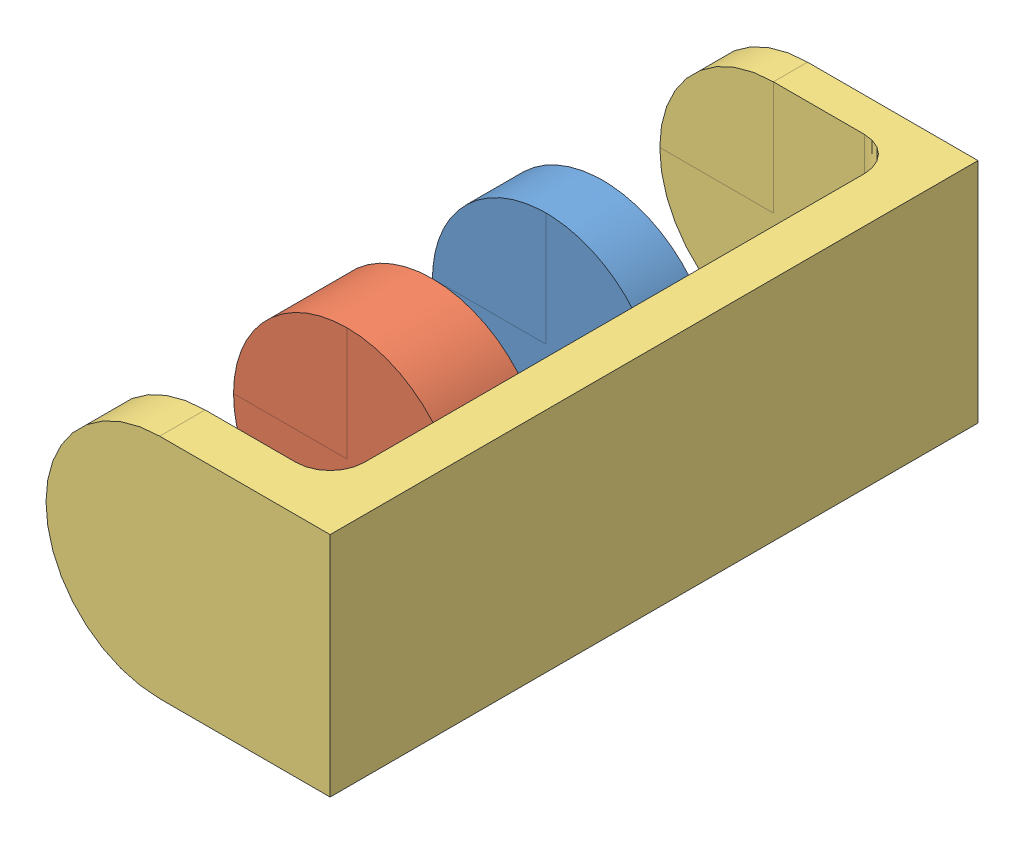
SolidWorks assembly 2DOF.SLDASM, configuration Default (file format 3800). Lengths in mm.
Overall size (500 400 1140).
3 component instances, 3 part files, 6 mates.
Components (placement in the parent):
- 2dof mass01-1: 2dof mass01.SLDPRT [Default] at (0 0 -199.804) x (0 1 0) z (0 0 1) size (400 400 99.72)
- 2dof mass02-1: 2dof mass02.SLDPRT [Default] at (0 0 99.92) x (0 1 0) z (0 0 1) size (400 400 150.08)
- 2dof frame-1: 2dof frame.SLDPRT [Default] at origin size (500 400 1140)
Mates (geometry in assembly coordinates):
- Parallel2: parallel aligned: line of 2dof mass01-1; line of 2dof mass02-1
- Distance2: distance = 200 mm anti-aligned: plane of 2dof mass01-1 through (0 0 -100.08) normal (0 0 1); plane of 2dof mass02-1 through (0 0 99.92) normal (0 0 -1)
- Concentric1: concentric aligned: cylinder of 2dof mass02-1; cylinder of 2dof frame-1
- Distance3: distance = 250 mm anti-aligned: plane of 2dof mass02-1 through (0 0 250) normal (0 0 1); plane of 2dof frame-1 through (0 0 500) normal (0 0 -1)
- Parallel4: parallel aligned: line of 2dof mass02-1; line of 2dof frame-1
- Concentric2: concentric aligned: cylinder of 2dof mass01-1; cylinder of 2dof mass02-1
